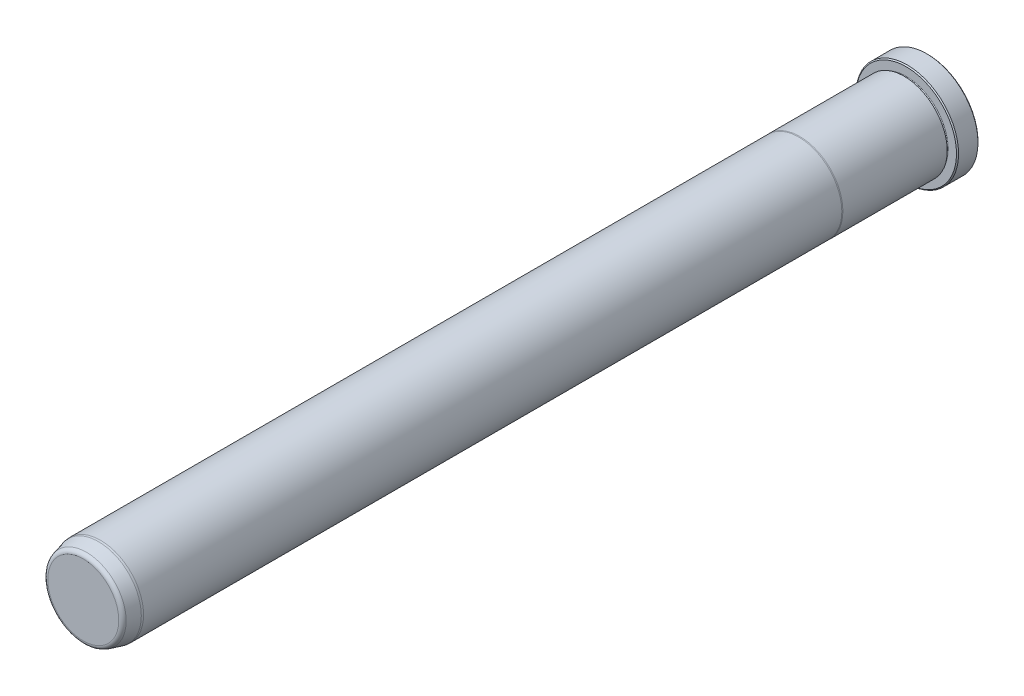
from build123d import *

# Parameters (mm, degrees)
FILLET6_R     = 1.5875
CHAMFER1_SIZE = 0.381


with BuildPart() as part:
    # Sketch1 → Revolve1 (revolve)
    with BuildSketch(Plane(origin=(0, 0, 0), x_dir=(0, 0, -1), z_dir=(1, 0, 0)), mode=Mode.PRIVATE) as revolve1_sk:
        with BuildLine():
            Line((0, 0), (0, 18.923))
            Line((0, 18.923), (-7.9248, 18.923))
            Line((-7.9248, 18.923), (-7.9248, 15.4813))
            ThreePointArc((-7.9248, 15.4813), (-8.3058, 15.1003), (-8.6868, 15.4813))
            Line((-8.6868, 15.4813), (-8.6868, 15.8877))
            Line((-8.6868, 15.8877), (-47.134763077, 15.8877))
            Line((-47.134763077, 15.8877), (-47.498, 15.8623))
            Line((-47.498, 15.8623), (-304.8, 15.8623))
            Line((-304.8, 15.8623), (-305.562, 15.795633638))
            Line((-305.562, 15.795633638), (-311.15, 14.298333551))
            Line((-311.15, 14.298333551), (-311.15, 0))
            Line((-311.15, 0), (0, 0))
        make_face()
    revolve(revolve1_sk.sketch.rotate(Axis((0, 0, 0), (0, 0, -1)), 90), axis=Axis((0, 0, 0), (0, 0, -1)))

    # Fillet6
    fillet6_edges = [part.edges().sort_by_distance(p)[0] for p in [
        (-14.298333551, 0, 311.15),
    ]]
    fillet(fillet6_edges, radius=FILLET6_R)

    # Chamfer1
    chamfer1_edges = [part.edges().sort_by_distance(p)[0] for p in [
        (-18.923, 0, 7.9248),
        (-18.923, 0, 0),
    ]]
    chamfer(chamfer1_edges, length=CHAMFER1_SIZE)


solid = part.part
